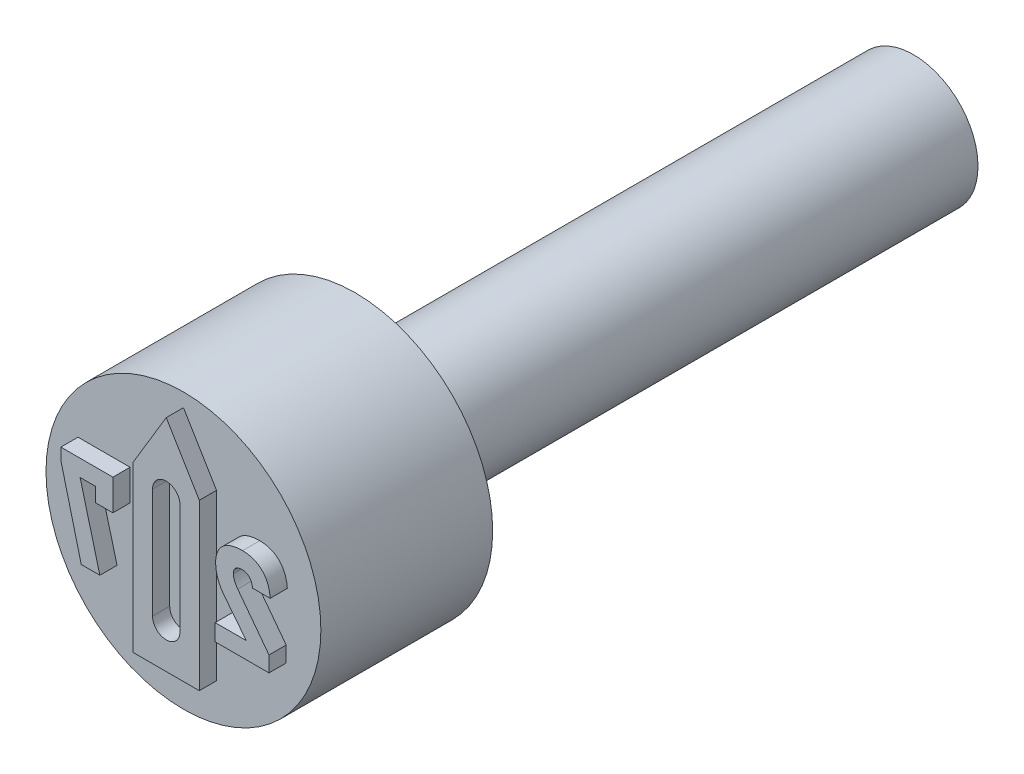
from build123d import *

# Parameters (mm, degrees)
BOSS_EXTRUDE1_DEPTH = 0.4
CUT_EXTRUDE1_DEPTH  = 0.4


with BuildPart() as part:
    # Sketch2 → Revolve1 (revolve)
    with BuildSketch(Plane(origin=(0, 0, 0), x_dir=(0, 0, -1), z_dir=(1, 0, 0)), mode=Mode.PRIVATE) as revolve1_sk:
        Polygon((0, 3.2), (0, 0), (17, 0), (17, 1.5), (4, 1.5), (4, 3.2), align=None)
    revolve(revolve1_sk.sketch.rotate(Axis((0, 0, -0.403888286), (0, 0, -1)), 90), axis=Axis((0, 0, -0.403888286), (0, 0, -1)))

    # Sketch3 → Boss-Extrude1 (add)
    with BuildSketch(Plane.XY):
        Polygon((-0.77, -2.24), (0.77, -2.24), (0.77, 1.6), (0, 2.881495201), (-0.77, 1.6), align=None)
        with BuildLine():
            Line((2.392238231, -1.07), (2.392238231, -0.707796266))
            Line((2.392238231, -0.707796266), (1.664372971, 0.256495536))
            add(Edge.make_bspline(
                [(1.664372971, 0.256495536), (1.649127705, 0.277976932), (1.619422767, 0.319832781), (1.592537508, 0.377313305), (1.575789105, 0.42237875), (1.567807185, 0.455060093), (1.562113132, 0.486241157), (1.561412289, 0.506729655), (1.561071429, 0.516694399)],
                knots=[0, 0, 0, 0, 1.664252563, 3.24274559, 3.998498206, 4.704056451, 5.369707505, 6, 6, 6, 6], degree=3))
            Line((1.561071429, 0.516694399), (1.561071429, 0.519719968))
            add(Edge.make_bspline(
                [(1.561071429, 0.519719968), (1.561661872, 0.533338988), (1.562793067, 0.55943086), (1.573450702, 0.59619482), (1.590917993, 0.628210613), (1.61593537, 0.654655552), (1.647080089, 0.675571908), (1.684345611, 0.690312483), (1.727244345, 0.698765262), (1.757693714, 0.699829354), (1.773725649, 0.70038961)],
                knots=[0, 0, 0, 0, 1.029992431, 1.973301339, 2.872554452, 3.768620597, 4.704316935, 5.693697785, 6.785705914, 8, 8, 8, 8], degree=3))
            add(Edge.make_bspline(
                [(1.773725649, 0.70038961), (1.789384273, 0.699778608), (1.819809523, 0.698591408), (1.86288165, 0.68543389), (1.901693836, 0.664795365), (1.935153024, 0.635346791), (1.962859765, 0.598372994), (1.985346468, 0.554833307), (2.000619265, 0.503941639), (2.006021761, 0.467511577), (2.008855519, 0.448403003)],
                knots=[0, 0, 0, 0, 0.980828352, 1.905783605, 2.800718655, 3.724477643, 4.680224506, 5.688112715, 6.78735127, 8, 8, 8, 8], degree=3))
            Line((2.008855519, 0.448403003), (2.008855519, 0.447106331))
            Line((2.008855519, 0.447106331), (2.418603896, 0.447106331))
            Line((2.418603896, 0.447106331), (2.418603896, 0.448403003))
            add(Edge.make_bspline(
                [(2.418603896, 0.448403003), (2.416582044, 0.4730927), (2.412635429, 0.521286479), (2.399696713, 0.591000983), (2.38297393, 0.656667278), (2.361700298, 0.718272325), (2.334363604, 0.775102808), (2.303649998, 0.828346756), (2.266709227, 0.876357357), (2.226272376, 0.920741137), (2.181232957, 0.959833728), (2.13320856, 0.994318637), (2.081472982, 1.02301567), (2.026812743, 1.046821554), (1.968621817, 1.064889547), (1.907660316, 1.078423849), (1.843228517, 1.086229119), (1.799247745, 1.087177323), (1.776751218, 1.087662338)],
                knots=[0, 0, 0, 0, 1.173229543, 2.290119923, 3.354877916, 4.382703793, 5.372196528, 6.339367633, 7.289741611, 8.236749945, 9.180232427, 10.11040526, 11.033485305, 11.978374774, 12.930610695, 13.916256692, 14.93414813, 16, 16, 16, 16], degree=3))
            add(Edge.make_bspline(
                [(1.776751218, 1.087662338), (1.752527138, 1.087318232), (1.705414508, 1.086648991), (1.636826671, 1.079424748), (1.572292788, 1.068521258), (1.511916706, 1.052569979), (1.455940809, 1.031762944), (1.404197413, 1.006674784), (1.356578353, 0.977091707), (1.313448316, 0.94295048), (1.274641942, 0.904871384), (1.241240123, 0.862467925), (1.212325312, 0.816597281), (1.189722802, 0.766369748), (1.1711146, 0.712966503), (1.159066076, 0.655430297), (1.150946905, 0.594438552), (1.150052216, 0.55245326), (1.149594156, 0.530957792)],
                knots=[0, 0, 0, 0, 1.219700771, 2.37215663, 3.469774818, 4.513610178, 5.512457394, 6.473141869, 7.405450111, 8.330272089, 9.238546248, 10.1372905, 11.043445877, 11.962355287, 12.905558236, 13.886315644, 14.917844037, 16, 16, 16, 16], degree=3))
            Line((1.149594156, 0.530957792), (1.149594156, 0.529228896))
            add(Edge.make_bspline(
                [(1.149594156, 0.529228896), (1.150145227, 0.504993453), (1.151248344, 0.456479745), (1.161205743, 0.38387222), (1.177251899, 0.311635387), (1.199288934, 0.240118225), (1.226664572, 0.170559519), (1.259520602, 0.103911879), (1.296602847, 0.040145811), (1.325987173, 0.00079018), (1.340637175, -0.018831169)],
                knots=[0, 0, 0, 0, 0.984368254, 1.970475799, 2.971844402, 3.988480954, 5.008197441, 6.005725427, 7.005724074, 8, 8, 8, 8], degree=3))
            Line((1.340637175, -0.018831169), (1.862763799, -0.682727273))
            Line((1.862763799, -0.682727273), (1.137924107, -0.682727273))
            Line((1.137924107, -0.682727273), (1.137924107, -1.07))
            Line((1.137924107, -1.07), (2.392238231, -1.07))
        make_face()
        Polygon((-2.454462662, 1.06), (-2.454462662, 0.792885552), (-1.979016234, -1.07), (-1.54592776, -1.07), (-2.006678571, 0.672727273), (-1.642313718, 0.672727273), (-1.642313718, 0.340779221), (-1.242506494, 0.340779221), (-1.242506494, 1.06), align=None)
    extrude(amount=BOSS_EXTRUDE1_DEPTH)

    # Sketch4 → Cut-Extrude1 (cut)
    with BuildSketch(Plane.XY.offset(0.4)):
        with BuildLine():
            Line((-0.32, 1.28), (-0.32, -1.28))
            ThreePointArc((-0.32, -1.28), (0, -1.6), (0.32, -1.28))
            Line((0.32, -1.28), (0.32, 1.28))
            ThreePointArc((0.32, 1.28), (0, 1.6), (-0.32, 1.28))
        make_face()
    extrude(amount=-CUT_EXTRUDE1_DEPTH, mode=Mode.SUBTRACT)


solid = part.part
